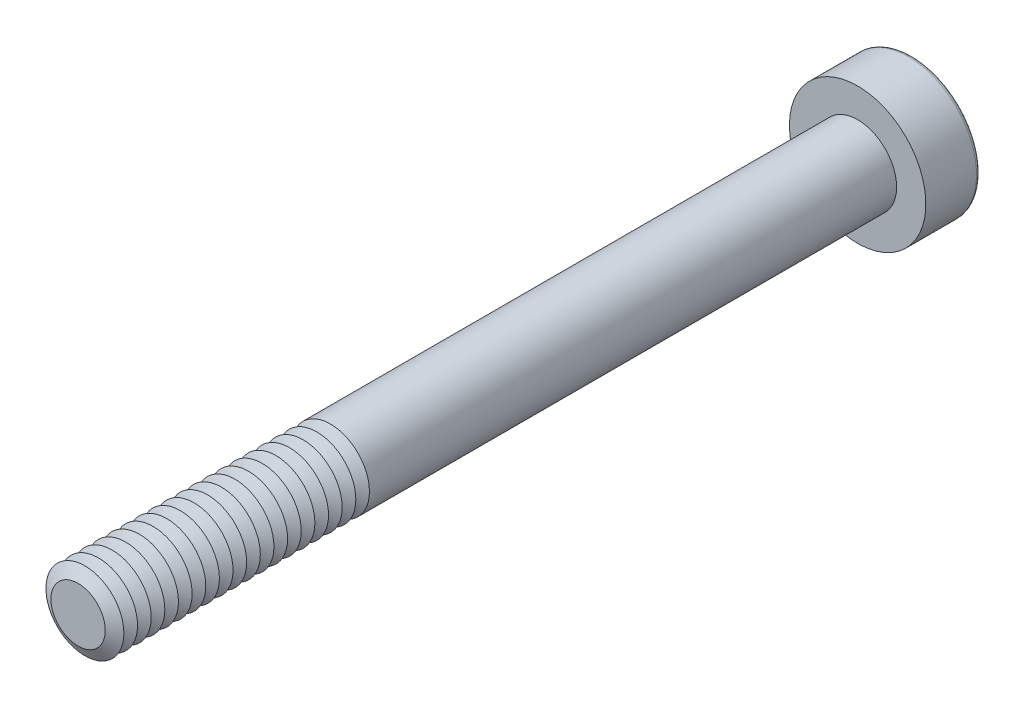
ISO-10303-21;
HEADER;
FILE_DESCRIPTION(('STEP AP214'),'2;1');
FILE_NAME('part.step','',(''),(''),'','','');
FILE_SCHEMA(('AUTOMOTIVE_DESIGN { 1 0 10303 214 1 1 1 1 }'));
ENDSEC;
DATA;
#1=APPLICATION_CONTEXT('core data for automotive mechanical design processes');
#2=APPLICATION_PROTOCOL_DEFINITION('international standard','automotive_design',2000,#1);
#3=PRODUCT_CONTEXT('',#1,'mechanical');
#4=PRODUCT('Part','Part','',(#3));
#5=PRODUCT_RELATED_PRODUCT_CATEGORY('part','',(#4));
#6=PRODUCT_DEFINITION_FORMATION('','',#4);
#7=PRODUCT_DEFINITION_CONTEXT('part definition',#1,'design');
#8=PRODUCT_DEFINITION('design','',#6,#7);
#9=PRODUCT_DEFINITION_SHAPE('','',#8);
#10=(LENGTH_UNIT() NAMED_UNIT(*) SI_UNIT(.MILLI.,.METRE.));
#11=(NAMED_UNIT(*) PLANE_ANGLE_UNIT() SI_UNIT($,.RADIAN.));
#12=(NAMED_UNIT(*) SI_UNIT($,.STERADIAN.) SOLID_ANGLE_UNIT());
#13=UNCERTAINTY_MEASURE_WITH_UNIT(LENGTH_MEASURE(1.E-05),#10,'distance_accuracy_value','');
#14=(GEOMETRIC_REPRESENTATION_CONTEXT(3) GLOBAL_UNCERTAINTY_ASSIGNED_CONTEXT((#13)) GLOBAL_UNIT_ASSIGNED_CONTEXT((#10,
#11,#12)) REPRESENTATION_CONTEXT('',''));
#15=CARTESIAN_POINT('',(0.,0.,0.));
#16=DIRECTION('',(0.,0.,1.));
#17=DIRECTION('',(1.,0.,0.));
#18=AXIS2_PLACEMENT_3D('',#15,#16,#17);
#19=CARTESIAN_POINT('',(0.,0.,37.55));
#20=DIRECTION('',(0.,0.,1.));
#21=DIRECTION('',(1.,0.,0.));
#22=AXIS2_PLACEMENT_3D('',#19,#20,#21);
#23=CONICAL_SURFACE('',#22,2.,1.04719755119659);
#24=CARTESIAN_POINT('',(0.,0.,37.2));
#25=DIRECTION('',(0.,0.,1.));
#26=DIRECTION('',(1.,0.,0.));
#27=AXIS2_PLACEMENT_3D('',#24,#25,#26);
#28=CIRCLE('',#27,1.39378221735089);
#29=CARTESIAN_POINT('',(1.39378221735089,0.,37.2));
#30=VERTEX_POINT('',#29);
#31=EDGE_CURVE('E314',#30,#30,#28,.T.);
#32=ORIENTED_EDGE('',*,*,#31,.T.);
#33=EDGE_LOOP('',(#32));
#34=FACE_BOUND('',#33,.T.);
#35=CARTESIAN_POINT('',(0.,0.,37.55));
#36=DIRECTION('',(0.,0.,1.));
#37=DIRECTION('',(1.,0.,0.));
#38=AXIS2_PLACEMENT_3D('',#35,#36,#37);
#39=CIRCLE('',#38,2.);
#40=CARTESIAN_POINT('',(2.,0.,37.55));
#41=VERTEX_POINT('',#40);
#42=EDGE_CURVE('E317',#41,#41,#39,.T.);
#43=ORIENTED_EDGE('',*,*,#42,.F.);
#44=EDGE_LOOP('',(#43));
#45=FACE_BOUND('',#44,.T.);
#46=ADVANCED_FACE('F39',(#34,#45),#23,.T.);
#47=CARTESIAN_POINT('',(0.,0.,37.2));
#48=DIRECTION('',(0.,0.,-1.));
#49=DIRECTION('',(-1.,0.,0.));
#50=AXIS2_PLACEMENT_3D('',#47,#48,#49);
#51=CONICAL_SURFACE('',#50,1.39378221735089,1.0471975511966);
#52=CARTESIAN_POINT('',(0.,0.,36.85));
#53=DIRECTION('',(0.,0.,1.));
#54=DIRECTION('',(1.,0.,0.));
#55=AXIS2_PLACEMENT_3D('',#52,#53,#54);
#56=CIRCLE('',#55,2.);
#57=CARTESIAN_POINT('',(2.,0.,36.85));
#58=VERTEX_POINT('',#57);
#59=EDGE_CURVE('E325',#58,#58,#56,.T.);
#60=ORIENTED_EDGE('',*,*,#59,.T.);
#61=EDGE_LOOP('',(#60));
#62=FACE_BOUND('',#61,.T.);
#63=ORIENTED_EDGE('',*,*,#31,.F.);
#64=EDGE_LOOP('',(#63));
#65=FACE_BOUND('',#64,.T.);
#66=ADVANCED_FACE('F245',(#62,#65),#51,.T.);
#67=CARTESIAN_POINT('',(0.,0.,40.));
#68=DIRECTION('',(0.,0.,1.));
#69=DIRECTION('',(1.,0.,0.));
#70=AXIS2_PLACEMENT_3D('',#67,#68,#69);
#71=PLANE('',#70);
#72=CARTESIAN_POINT('',(0.,0.,40.));
#73=DIRECTION('',(0.,0.,1.));
#74=DIRECTION('',(1.,0.,0.));
#75=AXIS2_PLACEMENT_3D('',#72,#73,#74);
#76=CIRCLE('',#75,1.39378221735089);
#77=CARTESIAN_POINT('',(1.39378221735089,0.,40.));
#78=VERTEX_POINT('',#77);
#79=EDGE_CURVE('E174',#78,#78,#76,.T.);
#80=ORIENTED_EDGE('',*,*,#79,.T.);
#81=EDGE_LOOP('',(#80));
#82=FACE_BOUND('',#81,.T.);
#83=ADVANCED_FACE('F251',(#82),#71,.T.);
#84=CARTESIAN_POINT('',(0.,0.,40.));
#85=DIRECTION('',(0.,0.,-1.));
#86=DIRECTION('',(-1.,0.,0.));
#87=AXIS2_PLACEMENT_3D('',#84,#85,#86);
#88=CONICAL_SURFACE('',#87,1.39378221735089,1.0471975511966);
#89=CARTESIAN_POINT('',(0.,0.,39.65));
#90=DIRECTION('',(0.,0.,1.));
#91=DIRECTION('',(1.,0.,0.));
#92=AXIS2_PLACEMENT_3D('',#89,#90,#91);
#93=CIRCLE('',#92,2.);
#94=CARTESIAN_POINT('',(2.,0.,39.65));
#95=VERTEX_POINT('',#94);
#96=EDGE_CURVE('E291',#95,#95,#93,.T.);
#97=ORIENTED_EDGE('',*,*,#96,.T.);
#98=EDGE_LOOP('',(#97));
#99=FACE_BOUND('',#98,.T.);
#100=ORIENTED_EDGE('',*,*,#79,.F.);
#101=EDGE_LOOP('',(#100));
#102=FACE_BOUND('',#101,.T.);
#103=ADVANCED_FACE('F199',(#99,#102),#88,.T.);
#104=CARTESIAN_POINT('',(0.,0.,39.65));
#105=DIRECTION('',(0.,0.,1.));
#106=DIRECTION('',(1.,0.,0.));
#107=AXIS2_PLACEMENT_3D('',#104,#105,#106);
#108=CONICAL_SURFACE('',#107,2.,1.04719755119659);
#109=CARTESIAN_POINT('',(0.,0.,39.3));
#110=DIRECTION('',(0.,0.,1.));
#111=DIRECTION('',(1.,0.,0.));
#112=AXIS2_PLACEMENT_3D('',#109,#110,#111);
#113=CIRCLE('',#112,1.39378221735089);
#114=CARTESIAN_POINT('',(1.39378221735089,0.,39.3));
#115=VERTEX_POINT('',#114);
#116=EDGE_CURVE('E288',#115,#115,#113,.T.);
#117=ORIENTED_EDGE('',*,*,#116,.T.);
#118=EDGE_LOOP('',(#117));
#119=FACE_BOUND('',#118,.T.);
#120=ORIENTED_EDGE('',*,*,#96,.F.);
#121=EDGE_LOOP('',(#120));
#122=FACE_BOUND('',#121,.T.);
#123=ADVANCED_FACE('F277',(#119,#122),#108,.T.);
#124=CARTESIAN_POINT('',(0.,0.,39.3));
#125=DIRECTION('',(0.,0.,-1.));
#126=DIRECTION('',(-1.,0.,0.));
#127=AXIS2_PLACEMENT_3D('',#124,#125,#126);
#128=CONICAL_SURFACE('',#127,1.39378221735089,1.0471975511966);
#129=CARTESIAN_POINT('',(0.,0.,38.95));
#130=DIRECTION('',(0.,0.,1.));
#131=DIRECTION('',(1.,0.,0.));
#132=AXIS2_PLACEMENT_3D('',#129,#130,#131);
#133=CIRCLE('',#132,2.);
#134=CARTESIAN_POINT('',(2.,0.,38.95));
#135=VERTEX_POINT('',#134);
#136=EDGE_CURVE('E300',#135,#135,#133,.T.);
#137=ORIENTED_EDGE('',*,*,#136,.T.);
#138=EDGE_LOOP('',(#137));
#139=FACE_BOUND('',#138,.T.);
#140=ORIENTED_EDGE('',*,*,#116,.F.);
#141=EDGE_LOOP('',(#140));
#142=FACE_BOUND('',#141,.T.);
#143=ADVANCED_FACE('F274',(#139,#142),#128,.T.);
#144=CARTESIAN_POINT('',(0.,0.,38.95));
#145=DIRECTION('',(0.,0.,1.));
#146=DIRECTION('',(1.,0.,0.));
#147=AXIS2_PLACEMENT_3D('',#144,#145,#146);
#148=CONICAL_SURFACE('',#147,2.,1.04719755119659);
#149=CARTESIAN_POINT('',(0.,0.,38.6));
#150=DIRECTION('',(0.,0.,1.));
#151=DIRECTION('',(1.,0.,0.));
#152=AXIS2_PLACEMENT_3D('',#149,#150,#151);
#153=CIRCLE('',#152,1.39378221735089);
#154=CARTESIAN_POINT('',(1.39378221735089,0.,38.6));
#155=VERTEX_POINT('',#154);
#156=EDGE_CURVE('E293',#155,#155,#153,.T.);
#157=ORIENTED_EDGE('',*,*,#156,.T.);
#158=EDGE_LOOP('',(#157));
#159=FACE_BOUND('',#158,.T.);
#160=ORIENTED_EDGE('',*,*,#136,.F.);
#161=EDGE_LOOP('',(#160));
#162=FACE_BOUND('',#161,.T.);
#163=ADVANCED_FACE('F270',(#159,#162),#148,.T.);
#164=CARTESIAN_POINT('',(0.,0.,38.6));
#165=DIRECTION('',(0.,0.,-1.));
#166=DIRECTION('',(-1.,0.,0.));
#167=AXIS2_PLACEMENT_3D('',#164,#165,#166);
#168=CONICAL_SURFACE('',#167,1.39378221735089,1.0471975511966);
#169=CARTESIAN_POINT('',(0.,0.,38.25));
#170=DIRECTION('',(0.,0.,1.));
#171=DIRECTION('',(1.,0.,0.));
#172=AXIS2_PLACEMENT_3D('',#169,#170,#171);
#173=CIRCLE('',#172,2.);
#174=CARTESIAN_POINT('',(2.,0.,38.25));
#175=VERTEX_POINT('',#174);
#176=EDGE_CURVE('E310',#175,#175,#173,.T.);
#177=ORIENTED_EDGE('',*,*,#176,.T.);
#178=EDGE_LOOP('',(#177));
#179=FACE_BOUND('',#178,.T.);
#180=ORIENTED_EDGE('',*,*,#156,.F.);
#181=EDGE_LOOP('',(#180));
#182=FACE_BOUND('',#181,.T.);
#183=ADVANCED_FACE('F266',(#179,#182),#168,.T.);
#184=CARTESIAN_POINT('',(0.,0.,38.25));
#185=DIRECTION('',(0.,0.,1.));
#186=DIRECTION('',(1.,0.,0.));
#187=AXIS2_PLACEMENT_3D('',#184,#185,#186);
#188=CONICAL_SURFACE('',#187,2.,1.04719755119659);
#189=CARTESIAN_POINT('',(0.,0.,37.9));
#190=DIRECTION('',(0.,0.,1.));
#191=DIRECTION('',(1.,0.,0.));
#192=AXIS2_PLACEMENT_3D('',#189,#190,#191);
#193=CIRCLE('',#192,1.39378221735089);
#194=CARTESIAN_POINT('',(1.39378221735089,0.,37.9));
#195=VERTEX_POINT('',#194);
#196=EDGE_CURVE('E306',#195,#195,#193,.T.);
#197=ORIENTED_EDGE('',*,*,#196,.T.);
#198=EDGE_LOOP('',(#197));
#199=FACE_BOUND('',#198,.T.);
#200=ORIENTED_EDGE('',*,*,#176,.F.);
#201=EDGE_LOOP('',(#200));
#202=FACE_BOUND('',#201,.T.);
#203=ADVANCED_FACE('F262',(#199,#202),#188,.T.);
#204=CARTESIAN_POINT('',(0.,0.,37.9));
#205=DIRECTION('',(0.,0.,-1.));
#206=DIRECTION('',(-1.,0.,0.));
#207=AXIS2_PLACEMENT_3D('',#204,#205,#206);
#208=CONICAL_SURFACE('',#207,1.39378221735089,1.0471975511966);
#209=ORIENTED_EDGE('',*,*,#42,.T.);
#210=EDGE_LOOP('',(#209));
#211=FACE_BOUND('',#210,.T.);
#212=ORIENTED_EDGE('',*,*,#196,.F.);
#213=EDGE_LOOP('',(#212));
#214=FACE_BOUND('',#213,.T.);
#215=ADVANCED_FACE('F258',(#211,#214),#208,.T.);
#216=CARTESIAN_POINT('',(0.,0.,36.85));
#217=DIRECTION('',(0.,0.,1.));
#218=DIRECTION('',(1.,0.,0.));
#219=AXIS2_PLACEMENT_3D('',#216,#217,#218);
#220=CONICAL_SURFACE('',#219,2.,1.04719755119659);
#221=CARTESIAN_POINT('',(0.,0.,36.5));
#222=DIRECTION('',(0.,0.,1.));
#223=DIRECTION('',(1.,0.,0.));
#224=AXIS2_PLACEMENT_3D('',#221,#222,#223);
#225=CIRCLE('',#224,1.39378221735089);
#226=CARTESIAN_POINT('',(1.39378221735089,0.,36.5));
#227=VERTEX_POINT('',#226);
#228=EDGE_CURVE('E321',#227,#227,#225,.T.);
#229=ORIENTED_EDGE('',*,*,#228,.T.);
#230=EDGE_LOOP('',(#229));
#231=FACE_BOUND('',#230,.T.);
#232=ORIENTED_EDGE('',*,*,#59,.F.);
#233=EDGE_LOOP('',(#232));
#234=FACE_BOUND('',#233,.T.);
#235=ADVANCED_FACE('F261',(#231,#234),#220,.T.);
#236=CARTESIAN_POINT('',(0.,0.,36.5));
#237=DIRECTION('',(0.,0.,-1.));
#238=DIRECTION('',(-1.,0.,0.));
#239=AXIS2_PLACEMENT_3D('',#236,#237,#238);
#240=CONICAL_SURFACE('',#239,1.39378221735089,1.0471975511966);
#241=CARTESIAN_POINT('',(0.,0.,36.15));
#242=DIRECTION('',(0.,0.,1.));
#243=DIRECTION('',(1.,0.,0.));
#244=AXIS2_PLACEMENT_3D('',#241,#242,#243);
#245=CIRCLE('',#244,2.);
#246=CARTESIAN_POINT('',(2.,0.,36.15));
#247=VERTEX_POINT('',#246);
#248=EDGE_CURVE('E333',#247,#247,#245,.T.);
#249=ORIENTED_EDGE('',*,*,#248,.T.);
#250=EDGE_LOOP('',(#249));
#251=FACE_BOUND('',#250,.T.);
#252=ORIENTED_EDGE('',*,*,#228,.F.);
#253=EDGE_LOOP('',(#252));
#254=FACE_BOUND('',#253,.T.);
#255=ADVANCED_FACE('F544',(#251,#254),#240,.T.);
#256=CARTESIAN_POINT('',(0.,0.,36.15));
#257=DIRECTION('',(0.,0.,1.));
#258=DIRECTION('',(1.,0.,0.));
#259=AXIS2_PLACEMENT_3D('',#256,#257,#258);
#260=CONICAL_SURFACE('',#259,2.,1.04719755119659);
#261=CARTESIAN_POINT('',(0.,0.,35.8));
#262=DIRECTION('',(0.,0.,1.));
#263=DIRECTION('',(1.,0.,0.));
#264=AXIS2_PLACEMENT_3D('',#261,#262,#263);
#265=CIRCLE('',#264,1.39378221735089);
#266=CARTESIAN_POINT('',(1.39378221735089,0.,35.8));
#267=VERTEX_POINT('',#266);
#268=EDGE_CURVE('E329',#267,#267,#265,.T.);
#269=ORIENTED_EDGE('',*,*,#268,.T.);
#270=EDGE_LOOP('',(#269));
#271=FACE_BOUND('',#270,.T.);
#272=ORIENTED_EDGE('',*,*,#248,.F.);
#273=EDGE_LOOP('',(#272));
#274=FACE_BOUND('',#273,.T.);
#275=ADVANCED_FACE('F540',(#271,#274),#260,.T.);
#276=CARTESIAN_POINT('',(0.,0.,35.8));
#277=DIRECTION('',(0.,0.,-1.));
#278=DIRECTION('',(-1.,0.,0.));
#279=AXIS2_PLACEMENT_3D('',#276,#277,#278);
#280=CONICAL_SURFACE('',#279,1.39378221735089,1.0471975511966);
#281=CARTESIAN_POINT('',(0.,0.,35.45));
#282=DIRECTION('',(0.,0.,1.));
#283=DIRECTION('',(1.,0.,0.));
#284=AXIS2_PLACEMENT_3D('',#281,#282,#283);
#285=CIRCLE('',#284,2.);
#286=CARTESIAN_POINT('',(2.,0.,35.45));
#287=VERTEX_POINT('',#286);
#288=EDGE_CURVE('E340',#287,#287,#285,.T.);
#289=ORIENTED_EDGE('',*,*,#288,.T.);
#290=EDGE_LOOP('',(#289));
#291=FACE_BOUND('',#290,.T.);
#292=ORIENTED_EDGE('',*,*,#268,.F.);
#293=EDGE_LOOP('',(#292));
#294=FACE_BOUND('',#293,.T.);
#295=ADVANCED_FACE('F536',(#291,#294),#280,.T.);
#296=CARTESIAN_POINT('',(0.,0.,35.45));
#297=DIRECTION('',(0.,0.,1.));
#298=DIRECTION('',(1.,0.,0.));
#299=AXIS2_PLACEMENT_3D('',#296,#297,#298);
#300=CONICAL_SURFACE('',#299,2.,1.04719755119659);
#301=CARTESIAN_POINT('',(0.,0.,35.1));
#302=DIRECTION('',(0.,0.,1.));
#303=DIRECTION('',(1.,0.,0.));
#304=AXIS2_PLACEMENT_3D('',#301,#302,#303);
#305=CIRCLE('',#304,1.39378221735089);
#306=CARTESIAN_POINT('',(1.39378221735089,0.,35.1));
#307=VERTEX_POINT('',#306);
#308=EDGE_CURVE('E337',#307,#307,#305,.T.);
#309=ORIENTED_EDGE('',*,*,#308,.T.);
#310=EDGE_LOOP('',(#309));
#311=FACE_BOUND('',#310,.T.);
#312=ORIENTED_EDGE('',*,*,#288,.F.);
#313=EDGE_LOOP('',(#312));
#314=FACE_BOUND('',#313,.T.);
#315=ADVANCED_FACE('F532',(#311,#314),#300,.T.);
#316=CARTESIAN_POINT('',(0.,0.,35.1));
#317=DIRECTION('',(0.,0.,-1.));
#318=DIRECTION('',(-1.,0.,0.));
#319=AXIS2_PLACEMENT_3D('',#316,#317,#318);
#320=CONICAL_SURFACE('',#319,1.39378221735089,1.0471975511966);
#321=CARTESIAN_POINT('',(0.,0.,34.75));
#322=DIRECTION('',(0.,0.,1.));
#323=DIRECTION('',(1.,0.,0.));
#324=AXIS2_PLACEMENT_3D('',#321,#322,#323);
#325=CIRCLE('',#324,2.);
#326=CARTESIAN_POINT('',(2.,0.,34.75));
#327=VERTEX_POINT('',#326);
#328=EDGE_CURVE('E347',#327,#327,#325,.T.);
#329=ORIENTED_EDGE('',*,*,#328,.T.);
#330=EDGE_LOOP('',(#329));
#331=FACE_BOUND('',#330,.T.);
#332=ORIENTED_EDGE('',*,*,#308,.F.);
#333=EDGE_LOOP('',(#332));
#334=FACE_BOUND('',#333,.T.);
#335=ADVANCED_FACE('F528',(#331,#334),#320,.T.);
#336=CARTESIAN_POINT('',(0.,0.,34.75));
#337=DIRECTION('',(0.,0.,1.));
#338=DIRECTION('',(1.,0.,0.));
#339=AXIS2_PLACEMENT_3D('',#336,#337,#338);
#340=CONICAL_SURFACE('',#339,2.,1.04719755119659);
#341=CARTESIAN_POINT('',(0.,0.,34.4));
#342=DIRECTION('',(0.,0.,1.));
#343=DIRECTION('',(1.,0.,0.));
#344=AXIS2_PLACEMENT_3D('',#341,#342,#343);
#345=CIRCLE('',#344,1.39378221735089);
#346=CARTESIAN_POINT('',(1.39378221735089,0.,34.4));
#347=VERTEX_POINT('',#346);
#348=EDGE_CURVE('E343',#347,#347,#345,.T.);
#349=ORIENTED_EDGE('',*,*,#348,.T.);
#350=EDGE_LOOP('',(#349));
#351=FACE_BOUND('',#350,.T.);
#352=ORIENTED_EDGE('',*,*,#328,.F.);
#353=EDGE_LOOP('',(#352));
#354=FACE_BOUND('',#353,.T.);
#355=ADVANCED_FACE('F524',(#351,#354),#340,.T.);
#356=CARTESIAN_POINT('',(0.,0.,34.4));
#357=DIRECTION('',(0.,0.,-1.));
#358=DIRECTION('',(-1.,0.,0.));
#359=AXIS2_PLACEMENT_3D('',#356,#357,#358);
#360=CONICAL_SURFACE('',#359,1.39378221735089,1.0471975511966);
#361=CARTESIAN_POINT('',(0.,0.,34.05));
#362=DIRECTION('',(0.,0.,1.));
#363=DIRECTION('',(1.,0.,0.));
#364=AXIS2_PLACEMENT_3D('',#361,#362,#363);
#365=CIRCLE('',#364,2.);
#366=CARTESIAN_POINT('',(2.,0.,34.05));
#367=VERTEX_POINT('',#366);
#368=EDGE_CURVE('E355',#367,#367,#365,.T.);
#369=ORIENTED_EDGE('',*,*,#368,.T.);
#370=EDGE_LOOP('',(#369));
#371=FACE_BOUND('',#370,.T.);
#372=ORIENTED_EDGE('',*,*,#348,.F.);
#373=EDGE_LOOP('',(#372));
#374=FACE_BOUND('',#373,.T.);
#375=ADVANCED_FACE('F520',(#371,#374),#360,.T.);
#376=CARTESIAN_POINT('',(0.,0.,34.05));
#377=DIRECTION('',(0.,0.,1.));
#378=DIRECTION('',(1.,0.,0.));
#379=AXIS2_PLACEMENT_3D('',#376,#377,#378);
#380=CONICAL_SURFACE('',#379,2.,1.04719755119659);
#381=CARTESIAN_POINT('',(0.,0.,33.7));
#382=DIRECTION('',(0.,0.,1.));
#383=DIRECTION('',(1.,0.,0.));
#384=AXIS2_PLACEMENT_3D('',#381,#382,#383);
#385=CIRCLE('',#384,1.39378221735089);
#386=CARTESIAN_POINT('',(1.39378221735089,0.,33.7));
#387=VERTEX_POINT('',#386);
#388=EDGE_CURVE('E351',#387,#387,#385,.T.);
#389=ORIENTED_EDGE('',*,*,#388,.T.);
#390=EDGE_LOOP('',(#389));
#391=FACE_BOUND('',#390,.T.);
#392=ORIENTED_EDGE('',*,*,#368,.F.);
#393=EDGE_LOOP('',(#392));
#394=FACE_BOUND('',#393,.T.);
#395=ADVANCED_FACE('F516',(#391,#394),#380,.T.);
#396=CARTESIAN_POINT('',(0.,0.,33.7));
#397=DIRECTION('',(0.,0.,-1.));
#398=DIRECTION('',(-1.,0.,0.));
#399=AXIS2_PLACEMENT_3D('',#396,#397,#398);
#400=CONICAL_SURFACE('',#399,1.39378221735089,1.0471975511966);
#401=CARTESIAN_POINT('',(0.,0.,33.35));
#402=DIRECTION('',(0.,0.,1.));
#403=DIRECTION('',(1.,0.,0.));
#404=AXIS2_PLACEMENT_3D('',#401,#402,#403);
#405=CIRCLE('',#404,2.);
#406=CARTESIAN_POINT('',(2.,0.,33.35));
#407=VERTEX_POINT('',#406);
#408=EDGE_CURVE('E363',#407,#407,#405,.T.);
#409=ORIENTED_EDGE('',*,*,#408,.T.);
#410=EDGE_LOOP('',(#409));
#411=FACE_BOUND('',#410,.T.);
#412=ORIENTED_EDGE('',*,*,#388,.F.);
#413=EDGE_LOOP('',(#412));
#414=FACE_BOUND('',#413,.T.);
#415=ADVANCED_FACE('F512',(#411,#414),#400,.T.);
#416=CARTESIAN_POINT('',(0.,0.,33.35));
#417=DIRECTION('',(0.,0.,1.));
#418=DIRECTION('',(1.,0.,0.));
#419=AXIS2_PLACEMENT_3D('',#416,#417,#418);
#420=CONICAL_SURFACE('',#419,2.,1.04719755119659);
#421=CARTESIAN_POINT('',(0.,0.,33.));
#422=DIRECTION('',(0.,0.,1.));
#423=DIRECTION('',(1.,0.,0.));
#424=AXIS2_PLACEMENT_3D('',#421,#422,#423);
#425=CIRCLE('',#424,1.39378221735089);
#426=CARTESIAN_POINT('',(1.39378221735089,0.,33.));
#427=VERTEX_POINT('',#426);
#428=EDGE_CURVE('E359',#427,#427,#425,.T.);
#429=ORIENTED_EDGE('',*,*,#428,.T.);
#430=EDGE_LOOP('',(#429));
#431=FACE_BOUND('',#430,.T.);
#432=ORIENTED_EDGE('',*,*,#408,.F.);
#433=EDGE_LOOP('',(#432));
#434=FACE_BOUND('',#433,.T.);
#435=ADVANCED_FACE('F508',(#431,#434),#420,.T.);
#436=CARTESIAN_POINT('',(0.,0.,33.));
#437=DIRECTION('',(0.,0.,-1.));
#438=DIRECTION('',(-1.,0.,0.));
#439=AXIS2_PLACEMENT_3D('',#436,#437,#438);
#440=CONICAL_SURFACE('',#439,1.39378221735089,1.0471975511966);
#441=CARTESIAN_POINT('',(0.,0.,32.65));
#442=DIRECTION('',(0.,0.,1.));
#443=DIRECTION('',(1.,0.,0.));
#444=AXIS2_PLACEMENT_3D('',#441,#442,#443);
#445=CIRCLE('',#444,2.);
#446=CARTESIAN_POINT('',(2.,0.,32.65));
#447=VERTEX_POINT('',#446);
#448=EDGE_CURVE('E371',#447,#447,#445,.T.);
#449=ORIENTED_EDGE('',*,*,#448,.T.);
#450=EDGE_LOOP('',(#449));
#451=FACE_BOUND('',#450,.T.);
#452=ORIENTED_EDGE('',*,*,#428,.F.);
#453=EDGE_LOOP('',(#452));
#454=FACE_BOUND('',#453,.T.);
#455=ADVANCED_FACE('F504',(#451,#454),#440,.T.);
#456=CARTESIAN_POINT('',(0.,0.,32.65));
#457=DIRECTION('',(0.,0.,1.));
#458=DIRECTION('',(1.,0.,0.));
#459=AXIS2_PLACEMENT_3D('',#456,#457,#458);
#460=CONICAL_SURFACE('',#459,2.,1.04719755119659);
#461=CARTESIAN_POINT('',(0.,0.,32.3));
#462=DIRECTION('',(0.,0.,1.));
#463=DIRECTION('',(1.,0.,0.));
#464=AXIS2_PLACEMENT_3D('',#461,#462,#463);
#465=CIRCLE('',#464,1.39378221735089);
#466=CARTESIAN_POINT('',(1.39378221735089,0.,32.3));
#467=VERTEX_POINT('',#466);
#468=EDGE_CURVE('E367',#467,#467,#465,.T.);
#469=ORIENTED_EDGE('',*,*,#468,.T.);
#470=EDGE_LOOP('',(#469));
#471=FACE_BOUND('',#470,.T.);
#472=ORIENTED_EDGE('',*,*,#448,.F.);
#473=EDGE_LOOP('',(#472));
#474=FACE_BOUND('',#473,.T.);
#475=ADVANCED_FACE('F500',(#471,#474),#460,.T.);
#476=CARTESIAN_POINT('',(0.,0.,32.3));
#477=DIRECTION('',(0.,0.,-1.));
#478=DIRECTION('',(-1.,0.,0.));
#479=AXIS2_PLACEMENT_3D('',#476,#477,#478);
#480=CONICAL_SURFACE('',#479,1.39378221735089,1.0471975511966);
#481=CARTESIAN_POINT('',(0.,0.,31.95));
#482=DIRECTION('',(0.,0.,1.));
#483=DIRECTION('',(1.,0.,0.));
#484=AXIS2_PLACEMENT_3D('',#481,#482,#483);
#485=CIRCLE('',#484,2.);
#486=CARTESIAN_POINT('',(2.,0.,31.95));
#487=VERTEX_POINT('',#486);
#488=EDGE_CURVE('E379',#487,#487,#485,.T.);
#489=ORIENTED_EDGE('',*,*,#488,.T.);
#490=EDGE_LOOP('',(#489));
#491=FACE_BOUND('',#490,.T.);
#492=ORIENTED_EDGE('',*,*,#468,.F.);
#493=EDGE_LOOP('',(#492));
#494=FACE_BOUND('',#493,.T.);
#495=ADVANCED_FACE('F496',(#491,#494),#480,.T.);
#496=CARTESIAN_POINT('',(0.,0.,31.95));
#497=DIRECTION('',(0.,0.,1.));
#498=DIRECTION('',(1.,0.,0.));
#499=AXIS2_PLACEMENT_3D('',#496,#497,#498);
#500=CONICAL_SURFACE('',#499,2.,1.04719755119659);
#501=CARTESIAN_POINT('',(0.,0.,31.6));
#502=DIRECTION('',(0.,0.,1.));
#503=DIRECTION('',(1.,0.,0.));
#504=AXIS2_PLACEMENT_3D('',#501,#502,#503);
#505=CIRCLE('',#504,1.39378221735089);
#506=CARTESIAN_POINT('',(1.39378221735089,0.,31.6));
#507=VERTEX_POINT('',#506);
#508=EDGE_CURVE('E375',#507,#507,#505,.T.);
#509=ORIENTED_EDGE('',*,*,#508,.T.);
#510=EDGE_LOOP('',(#509));
#511=FACE_BOUND('',#510,.T.);
#512=ORIENTED_EDGE('',*,*,#488,.F.);
#513=EDGE_LOOP('',(#512));
#514=FACE_BOUND('',#513,.T.);
#515=ADVANCED_FACE('F492',(#511,#514),#500,.T.);
#516=CARTESIAN_POINT('',(0.,0.,31.6));
#517=DIRECTION('',(0.,0.,-1.));
#518=DIRECTION('',(-1.,0.,0.));
#519=AXIS2_PLACEMENT_3D('',#516,#517,#518);
#520=CONICAL_SURFACE('',#519,1.39378221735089,1.0471975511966);
#521=CARTESIAN_POINT('',(0.,0.,31.25));
#522=DIRECTION('',(0.,0.,1.));
#523=DIRECTION('',(1.,0.,0.));
#524=AXIS2_PLACEMENT_3D('',#521,#522,#523);
#525=CIRCLE('',#524,2.);
#526=CARTESIAN_POINT('',(2.,0.,31.25));
#527=VERTEX_POINT('',#526);
#528=EDGE_CURVE('E387',#527,#527,#525,.T.);
#529=ORIENTED_EDGE('',*,*,#528,.T.);
#530=EDGE_LOOP('',(#529));
#531=FACE_BOUND('',#530,.T.);
#532=ORIENTED_EDGE('',*,*,#508,.F.);
#533=EDGE_LOOP('',(#532));
#534=FACE_BOUND('',#533,.T.);
#535=ADVANCED_FACE('F488',(#531,#534),#520,.T.);
#536=CARTESIAN_POINT('',(0.,0.,31.25));
#537=DIRECTION('',(0.,0.,1.));
#538=DIRECTION('',(1.,0.,0.));
#539=AXIS2_PLACEMENT_3D('',#536,#537,#538);
#540=CONICAL_SURFACE('',#539,2.,1.04719755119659);
#541=CARTESIAN_POINT('',(0.,0.,30.9));
#542=DIRECTION('',(0.,0.,1.));
#543=DIRECTION('',(1.,0.,0.));
#544=AXIS2_PLACEMENT_3D('',#541,#542,#543);
#545=CIRCLE('',#544,1.39378221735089);
#546=CARTESIAN_POINT('',(1.39378221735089,0.,30.9));
#547=VERTEX_POINT('',#546);
#548=EDGE_CURVE('E383',#547,#547,#545,.T.);
#549=ORIENTED_EDGE('',*,*,#548,.T.);
#550=EDGE_LOOP('',(#549));
#551=FACE_BOUND('',#550,.T.);
#552=ORIENTED_EDGE('',*,*,#528,.F.);
#553=EDGE_LOOP('',(#552));
#554=FACE_BOUND('',#553,.T.);
#555=ADVANCED_FACE('F484',(#551,#554),#540,.T.);
#556=CARTESIAN_POINT('',(0.,0.,30.9));
#557=DIRECTION('',(0.,0.,-1.));
#558=DIRECTION('',(-1.,0.,0.));
#559=AXIS2_PLACEMENT_3D('',#556,#557,#558);
#560=CONICAL_SURFACE('',#559,1.39378221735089,1.0471975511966);
#561=CARTESIAN_POINT('',(0.,0.,30.55));
#562=DIRECTION('',(0.,0.,1.));
#563=DIRECTION('',(1.,0.,0.));
#564=AXIS2_PLACEMENT_3D('',#561,#562,#563);
#565=CIRCLE('',#564,2.);
#566=CARTESIAN_POINT('',(2.,0.,30.55));
#567=VERTEX_POINT('',#566);
#568=EDGE_CURVE('E395',#567,#567,#565,.T.);
#569=ORIENTED_EDGE('',*,*,#568,.T.);
#570=EDGE_LOOP('',(#569));
#571=FACE_BOUND('',#570,.T.);
#572=ORIENTED_EDGE('',*,*,#548,.F.);
#573=EDGE_LOOP('',(#572));
#574=FACE_BOUND('',#573,.T.);
#575=ADVANCED_FACE('F480',(#571,#574),#560,.T.);
#576=CARTESIAN_POINT('',(0.,0.,30.55));
#577=DIRECTION('',(0.,0.,1.));
#578=DIRECTION('',(1.,0.,0.));
#579=AXIS2_PLACEMENT_3D('',#576,#577,#578);
#580=CONICAL_SURFACE('',#579,2.,1.04719755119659);
#581=CARTESIAN_POINT('',(0.,0.,30.2));
#582=DIRECTION('',(0.,0.,1.));
#583=DIRECTION('',(1.,0.,0.));
#584=AXIS2_PLACEMENT_3D('',#581,#582,#583);
#585=CIRCLE('',#584,1.39378221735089);
#586=CARTESIAN_POINT('',(1.39378221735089,0.,30.2));
#587=VERTEX_POINT('',#586);
#588=EDGE_CURVE('E391',#587,#587,#585,.T.);
#589=ORIENTED_EDGE('',*,*,#588,.T.);
#590=EDGE_LOOP('',(#589));
#591=FACE_BOUND('',#590,.T.);
#592=ORIENTED_EDGE('',*,*,#568,.F.);
#593=EDGE_LOOP('',(#592));
#594=FACE_BOUND('',#593,.T.);
#595=ADVANCED_FACE('F476',(#591,#594),#580,.T.);
#596=CARTESIAN_POINT('',(0.,0.,30.2));
#597=DIRECTION('',(0.,0.,-1.));
#598=DIRECTION('',(-1.,0.,0.));
#599=AXIS2_PLACEMENT_3D('',#596,#597,#598);
#600=CONICAL_SURFACE('',#599,1.39378221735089,1.0471975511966);
#601=CARTESIAN_POINT('',(0.,0.,29.85));
#602=DIRECTION('',(0.,0.,1.));
#603=DIRECTION('',(1.,0.,0.));
#604=AXIS2_PLACEMENT_3D('',#601,#602,#603);
#605=CIRCLE('',#604,2.);
#606=CARTESIAN_POINT('',(2.,0.,29.85));
#607=VERTEX_POINT('',#606);
#608=EDGE_CURVE('E403',#607,#607,#605,.T.);
#609=ORIENTED_EDGE('',*,*,#608,.T.);
#610=EDGE_LOOP('',(#609));
#611=FACE_BOUND('',#610,.T.);
#612=ORIENTED_EDGE('',*,*,#588,.F.);
#613=EDGE_LOOP('',(#612));
#614=FACE_BOUND('',#613,.T.);
#615=ADVANCED_FACE('F472',(#611,#614),#600,.T.);
#616=CARTESIAN_POINT('',(0.,0.,29.85));
#617=DIRECTION('',(0.,0.,1.));
#618=DIRECTION('',(1.,0.,0.));
#619=AXIS2_PLACEMENT_3D('',#616,#617,#618);
#620=CONICAL_SURFACE('',#619,2.,1.04719755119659);
#621=CARTESIAN_POINT('',(0.,0.,29.5));
#622=DIRECTION('',(0.,0.,1.));
#623=DIRECTION('',(1.,0.,0.));
#624=AXIS2_PLACEMENT_3D('',#621,#622,#623);
#625=CIRCLE('',#624,1.39378221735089);
#626=CARTESIAN_POINT('',(1.39378221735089,0.,29.5));
#627=VERTEX_POINT('',#626);
#628=EDGE_CURVE('E399',#627,#627,#625,.T.);
#629=ORIENTED_EDGE('',*,*,#628,.T.);
#630=EDGE_LOOP('',(#629));
#631=FACE_BOUND('',#630,.T.);
#632=ORIENTED_EDGE('',*,*,#608,.F.);
#633=EDGE_LOOP('',(#632));
#634=FACE_BOUND('',#633,.T.);
#635=ADVANCED_FACE('F468',(#631,#634),#620,.T.);
#636=CARTESIAN_POINT('',(0.,0.,29.5));
#637=DIRECTION('',(0.,0.,-1.));
#638=DIRECTION('',(-1.,0.,0.));
#639=AXIS2_PLACEMENT_3D('',#636,#637,#638);
#640=CONICAL_SURFACE('',#639,1.39378221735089,1.0471975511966);
#641=CARTESIAN_POINT('',(0.,0.,29.15));
#642=DIRECTION('',(0.,0.,1.));
#643=DIRECTION('',(1.,0.,0.));
#644=AXIS2_PLACEMENT_3D('',#641,#642,#643);
#645=CIRCLE('',#644,2.);
#646=CARTESIAN_POINT('',(2.,0.,29.15));
#647=VERTEX_POINT('',#646);
#648=EDGE_CURVE('E411',#647,#647,#645,.T.);
#649=ORIENTED_EDGE('',*,*,#648,.T.);
#650=EDGE_LOOP('',(#649));
#651=FACE_BOUND('',#650,.T.);
#652=ORIENTED_EDGE('',*,*,#628,.F.);
#653=EDGE_LOOP('',(#652));
#654=FACE_BOUND('',#653,.T.);
#655=ADVANCED_FACE('F464',(#651,#654),#640,.T.);
#656=CARTESIAN_POINT('',(0.,0.,29.15));
#657=DIRECTION('',(0.,0.,1.));
#658=DIRECTION('',(1.,0.,0.));
#659=AXIS2_PLACEMENT_3D('',#656,#657,#658);
#660=CONICAL_SURFACE('',#659,2.,1.04719755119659);
#661=CARTESIAN_POINT('',(0.,0.,28.8));
#662=DIRECTION('',(0.,0.,1.));
#663=DIRECTION('',(1.,0.,0.));
#664=AXIS2_PLACEMENT_3D('',#661,#662,#663);
#665=CIRCLE('',#664,1.39378221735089);
#666=CARTESIAN_POINT('',(1.39378221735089,0.,28.8));
#667=VERTEX_POINT('',#666);
#668=EDGE_CURVE('E407',#667,#667,#665,.T.);
#669=ORIENTED_EDGE('',*,*,#668,.T.);
#670=EDGE_LOOP('',(#669));
#671=FACE_BOUND('',#670,.T.);
#672=ORIENTED_EDGE('',*,*,#648,.F.);
#673=EDGE_LOOP('',(#672));
#674=FACE_BOUND('',#673,.T.);
#675=ADVANCED_FACE('F460',(#671,#674),#660,.T.);
#676=CARTESIAN_POINT('',(0.,0.,28.8));
#677=DIRECTION('',(0.,0.,-1.));
#678=DIRECTION('',(-1.,0.,0.));
#679=AXIS2_PLACEMENT_3D('',#676,#677,#678);
#680=CONICAL_SURFACE('',#679,1.39378221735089,1.0471975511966);
#681=CARTESIAN_POINT('',(0.,0.,28.45));
#682=DIRECTION('',(0.,0.,1.));
#683=DIRECTION('',(1.,0.,0.));
#684=AXIS2_PLACEMENT_3D('',#681,#682,#683);
#685=CIRCLE('',#684,2.);
#686=CARTESIAN_POINT('',(2.,0.,28.45));
#687=VERTEX_POINT('',#686);
#688=EDGE_CURVE('E419',#687,#687,#685,.T.);
#689=ORIENTED_EDGE('',*,*,#688,.T.);
#690=EDGE_LOOP('',(#689));
#691=FACE_BOUND('',#690,.T.);
#692=ORIENTED_EDGE('',*,*,#668,.F.);
#693=EDGE_LOOP('',(#692));
#694=FACE_BOUND('',#693,.T.);
#695=ADVANCED_FACE('F456',(#691,#694),#680,.T.);
#696=CARTESIAN_POINT('',(0.,0.,28.45));
#697=DIRECTION('',(0.,0.,1.));
#698=DIRECTION('',(1.,0.,0.));
#699=AXIS2_PLACEMENT_3D('',#696,#697,#698);
#700=CONICAL_SURFACE('',#699,2.,1.04719755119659);
#701=CARTESIAN_POINT('',(0.,0.,28.1));
#702=DIRECTION('',(0.,0.,1.));
#703=DIRECTION('',(1.,0.,0.));
#704=AXIS2_PLACEMENT_3D('',#701,#702,#703);
#705=CIRCLE('',#704,1.39378221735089);
#706=CARTESIAN_POINT('',(1.39378221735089,0.,28.1));
#707=VERTEX_POINT('',#706);
#708=EDGE_CURVE('E415',#707,#707,#705,.T.);
#709=ORIENTED_EDGE('',*,*,#708,.T.);
#710=EDGE_LOOP('',(#709));
#711=FACE_BOUND('',#710,.T.);
#712=ORIENTED_EDGE('',*,*,#688,.F.);
#713=EDGE_LOOP('',(#712));
#714=FACE_BOUND('',#713,.T.);
#715=ADVANCED_FACE('F451',(#711,#714),#700,.T.);
#716=CARTESIAN_POINT('',(0.,0.,28.1));
#717=DIRECTION('',(0.,0.,-1.));
#718=DIRECTION('',(-1.,0.,0.));
#719=AXIS2_PLACEMENT_3D('',#716,#717,#718);
#720=CONICAL_SURFACE('',#719,1.39378221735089,1.0471975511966);
#721=CARTESIAN_POINT('',(0.,0.,27.75));
#722=DIRECTION('',(0.,0.,1.));
#723=DIRECTION('',(1.,0.,0.));
#724=AXIS2_PLACEMENT_3D('',#721,#722,#723);
#725=CIRCLE('',#724,2.);
#726=CARTESIAN_POINT('',(2.,0.,27.75));
#727=VERTEX_POINT('',#726);
#728=EDGE_CURVE('E431',#727,#727,#725,.T.);
#729=ORIENTED_EDGE('',*,*,#728,.T.);
#730=EDGE_LOOP('',(#729));
#731=FACE_BOUND('',#730,.T.);
#732=ORIENTED_EDGE('',*,*,#708,.F.);
#733=EDGE_LOOP('',(#732));
#734=FACE_BOUND('',#733,.T.);
#735=ADVANCED_FACE('F437',(#731,#734),#720,.T.);
#736=CARTESIAN_POINT('',(0.,0.,27.75));
#737=DIRECTION('',(0.,0.,1.));
#738=DIRECTION('',(1.,0.,0.));
#739=AXIS2_PLACEMENT_3D('',#736,#737,#738);
#740=CONICAL_SURFACE('',#739,2.,1.04719755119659);
#741=CARTESIAN_POINT('',(0.,0.,27.4));
#742=DIRECTION('',(0.,0.,1.));
#743=DIRECTION('',(1.,0.,0.));
#744=AXIS2_PLACEMENT_3D('',#741,#742,#743);
#745=CIRCLE('',#744,1.39378221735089);
#746=CARTESIAN_POINT('',(1.39378221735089,0.,27.4));
#747=VERTEX_POINT('',#746);
#748=EDGE_CURVE('E423',#747,#747,#745,.T.);
#749=ORIENTED_EDGE('',*,*,#748,.T.);
#750=EDGE_LOOP('',(#749));
#751=FACE_BOUND('',#750,.T.);
#752=ORIENTED_EDGE('',*,*,#728,.F.);
#753=EDGE_LOOP('',(#752));
#754=FACE_BOUND('',#753,.T.);
#755=ADVANCED_FACE('F440',(#751,#754),#740,.T.);
#756=CARTESIAN_POINT('',(0.,0.,27.4));
#757=DIRECTION('',(0.,0.,-1.));
#758=DIRECTION('',(-1.,0.,0.));
#759=AXIS2_PLACEMENT_3D('',#756,#757,#758);
#760=CONICAL_SURFACE('',#759,1.39378221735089,1.0471975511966);
#761=CARTESIAN_POINT('',(0.,0.,27.05));
#762=DIRECTION('',(0.,0.,1.));
#763=DIRECTION('',(1.,0.,0.));
#764=AXIS2_PLACEMENT_3D('',#761,#762,#763);
#765=CIRCLE('',#764,2.);
#766=CARTESIAN_POINT('',(2.,0.,27.05));
#767=VERTEX_POINT('',#766);
#768=EDGE_CURVE('E427',#767,#767,#765,.T.);
#769=ORIENTED_EDGE('',*,*,#768,.T.);
#770=EDGE_LOOP('',(#769));
#771=FACE_BOUND('',#770,.T.);
#772=ORIENTED_EDGE('',*,*,#748,.F.);
#773=EDGE_LOOP('',(#772));
#774=FACE_BOUND('',#773,.T.);
#775=ADVANCED_FACE('F442',(#771,#774),#760,.T.);
#776=CARTESIAN_POINT('',(0.,0.,-0.925));
#777=DIRECTION('',(0.,0.,-1.));
#778=DIRECTION('',(-1.,0.,0.));
#779=AXIS2_PLACEMENT_3D('',#776,#777,#778);
#780=CONICAL_SURFACE('',#779,1.25,1.0471975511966);
#781=CARTESIAN_POINT('',(0.,0.,-0.203312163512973));
#782=VERTEX_POINT('',#781);
#783=VERTEX_LOOP('',#782);
#784=FACE_BOUND('',#783,.T.);
#785=CARTESIAN_POINT('',(0.,0.,-0.925));
#786=DIRECTION('',(0.,0.,-1.));
#787=DIRECTION('',(-1.,0.,0.));
#788=AXIS2_PLACEMENT_3D('',#785,#786,#787);
#789=CIRCLE('',#788,1.25);
#790=CARTESIAN_POINT('',(-1.08253175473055,0.624999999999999,-0.925));
#791=VERTEX_POINT('',#790);
#792=CARTESIAN_POINT('',(0.,1.25,-0.925));
#793=VERTEX_POINT('',#792);
#794=EDGE_CURVE('E149',#791,#793,#789,.T.);
#795=ORIENTED_EDGE('',*,*,#794,.T.);
#796=CARTESIAN_POINT('',(0.,0.,-0.925));
#797=DIRECTION('',(0.,0.,-1.));
#798=DIRECTION('',(-1.,0.,0.));
#799=AXIS2_PLACEMENT_3D('',#796,#797,#798);
#800=CIRCLE('',#799,1.25);
#801=CARTESIAN_POINT('',(1.08253175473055,0.625,-0.925));
#802=VERTEX_POINT('',#801);
#803=EDGE_CURVE('E54',#793,#802,#800,.T.);
#804=ORIENTED_EDGE('',*,*,#803,.T.);
#805=CARTESIAN_POINT('',(1.08253175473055,-0.624999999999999,-0.925));
#806=VERTEX_POINT('',#805);
#807=EDGE_CURVE('E1085',#802,#806,#800,.T.);
#808=ORIENTED_EDGE('',*,*,#807,.T.);
#809=CARTESIAN_POINT('',(0.,-1.25,-0.925));
#810=VERTEX_POINT('',#809);
#811=EDGE_CURVE('E1083',#806,#810,#800,.T.);
#812=ORIENTED_EDGE('',*,*,#811,.T.);
#813=CARTESIAN_POINT('',(-1.08253175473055,-0.624999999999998,-0.925));
#814=VERTEX_POINT('',#813);
#815=EDGE_CURVE('E1079',#810,#814,#800,.T.);
#816=ORIENTED_EDGE('',*,*,#815,.T.);
#817=EDGE_CURVE('E1077',#814,#791,#800,.T.);
#818=ORIENTED_EDGE('',*,*,#817,.T.);
#819=EDGE_LOOP('',(#795,#804,#808,#812,#816,#818));
#820=FACE_BOUND('',#819,.T.);
#821=ADVANCED_FACE('F201',(#784,#820),#780,.F.);
#822=CARTESIAN_POINT('',(0.,0.,-0.925));
#823=DIRECTION('',(0.,0.,-1.));
#824=DIRECTION('',(-1.,0.,0.));
#825=AXIS2_PLACEMENT_3D('',#822,#823,#824);
#826=PLANE('',#825);
#827=ORIENTED_EDGE('',*,*,#803,.F.);
#828=DIRECTION('',(1.,0.,0.));
#829=VECTOR('',#828,1.);
#830=CARTESIAN_POINT('',(-0.721687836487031,1.25,-0.925));
#831=LINE('',#830,#829);
#832=CARTESIAN_POINT('',(0.721687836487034,1.25,-0.925));
#833=VERTEX_POINT('',#832);
#834=EDGE_CURVE('E1127',#793,#833,#831,.T.);
#835=ORIENTED_EDGE('',*,*,#834,.T.);
#836=DIRECTION('',(0.5,-0.866025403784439,0.));
#837=VECTOR('',#836,1.);
#838=CARTESIAN_POINT('',(0.721687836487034,1.25,-0.925));
#839=LINE('',#838,#837);
#840=EDGE_CURVE('E155',#833,#802,#839,.T.);
#841=ORIENTED_EDGE('',*,*,#840,.T.);
#842=EDGE_LOOP('',(#827,#835,#841));
#843=FACE_BOUND('',#842,.T.);
#844=ADVANCED_FACE('F651',(#843),#826,.T.);
#845=ORIENTED_EDGE('',*,*,#807,.F.);
#846=CARTESIAN_POINT('',(1.44337567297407,0.,-0.925));
#847=VERTEX_POINT('',#846);
#848=EDGE_CURVE('E1129',#802,#847,#839,.T.);
#849=ORIENTED_EDGE('',*,*,#848,.T.);
#850=DIRECTION('',(-0.5,-0.866025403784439,0.));
#851=VECTOR('',#850,1.);
#852=CARTESIAN_POINT('',(1.44337567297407,0.,-0.925));
#853=LINE('',#852,#851);
#854=EDGE_CURVE('E1099',#847,#806,#853,.T.);
#855=ORIENTED_EDGE('',*,*,#854,.T.);
#856=EDGE_LOOP('',(#845,#849,#855));
#857=FACE_BOUND('',#856,.T.);
#858=ADVANCED_FACE('F661',(#857),#826,.T.);
#859=ORIENTED_EDGE('',*,*,#811,.F.);
#860=CARTESIAN_POINT('',(0.721687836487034,-1.25,-0.925));
#861=VERTEX_POINT('',#860);
#862=EDGE_CURVE('E1101',#806,#861,#853,.T.);
#863=ORIENTED_EDGE('',*,*,#862,.T.);
#864=DIRECTION('',(-1.,0.,0.));
#865=VECTOR('',#864,1.);
#866=CARTESIAN_POINT('',(0.721687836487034,-1.25,-0.925));
#867=LINE('',#866,#865);
#868=EDGE_CURVE('E1054',#861,#810,#867,.T.);
#869=ORIENTED_EDGE('',*,*,#868,.T.);
#870=EDGE_LOOP('',(#859,#863,#869));
#871=FACE_BOUND('',#870,.T.);
#872=ADVANCED_FACE('F671',(#871),#826,.T.);
#873=ORIENTED_EDGE('',*,*,#815,.F.);
#874=CARTESIAN_POINT('',(-0.721687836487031,-1.25,-0.925));
#875=VERTEX_POINT('',#874);
#876=EDGE_CURVE('E1095',#810,#875,#867,.T.);
#877=ORIENTED_EDGE('',*,*,#876,.T.);
#878=DIRECTION('',(-0.499999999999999,0.866025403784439,0.));
#879=VECTOR('',#878,1.);
#880=CARTESIAN_POINT('',(-0.721687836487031,-1.25,-0.925));
#881=LINE('',#880,#879);
#882=EDGE_CURVE('E1097',#875,#814,#881,.T.);
#883=ORIENTED_EDGE('',*,*,#882,.T.);
#884=EDGE_LOOP('',(#873,#877,#883));
#885=FACE_BOUND('',#884,.T.);
#886=ADVANCED_FACE('F679',(#885),#826,.T.);
#887=ORIENTED_EDGE('',*,*,#817,.F.);
#888=CARTESIAN_POINT('',(-1.44337567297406,0.,-0.925));
#889=VERTEX_POINT('',#888);
#890=EDGE_CURVE('E1103',#814,#889,#881,.T.);
#891=ORIENTED_EDGE('',*,*,#890,.T.);
#892=DIRECTION('',(0.499999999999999,0.866025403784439,0.));
#893=VECTOR('',#892,1.);
#894=CARTESIAN_POINT('',(-1.44337567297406,0.,-0.925));
#895=LINE('',#894,#893);
#896=EDGE_CURVE('E158',#889,#791,#895,.T.);
#897=ORIENTED_EDGE('',*,*,#896,.T.);
#898=EDGE_LOOP('',(#887,#891,#897));
#899=FACE_BOUND('',#898,.T.);
#900=ADVANCED_FACE('F231',(#899),#826,.T.);
#901=ORIENTED_EDGE('',*,*,#794,.F.);
#902=CARTESIAN_POINT('',(-0.721687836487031,1.25,-0.925));
#903=VERTEX_POINT('',#902);
#904=EDGE_CURVE('E1111',#791,#903,#895,.T.);
#905=ORIENTED_EDGE('',*,*,#904,.T.);
#906=EDGE_CURVE('E1125',#903,#793,#831,.T.);
#907=ORIENTED_EDGE('',*,*,#906,.T.);
#908=EDGE_LOOP('',(#901,#905,#907));
#909=FACE_BOUND('',#908,.T.);
#910=ADVANCED_FACE('F663',(#909),#826,.T.);
#911=CARTESIAN_POINT('',(-0.721687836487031,1.25,-0.925));
#912=DIRECTION('',(0.,1.,0.));
#913=DIRECTION('',(0.,0.,1.));
#914=AXIS2_PLACEMENT_3D('',#911,#912,#913);
#915=PLANE('',#914);
#916=DIRECTION('',(0.,0.,-1.));
#917=VECTOR('',#916,1.);
#918=CARTESIAN_POINT('',(-0.721687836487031,1.25,-0.925));
#919=LINE('',#918,#917);
#920=CARTESIAN_POINT('',(-0.721687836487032,1.25,-2.8));
#921=VERTEX_POINT('',#920);
#922=EDGE_CURVE('E147',#903,#921,#919,.T.);
#923=ORIENTED_EDGE('',*,*,#922,.T.);
#924=CARTESIAN_POINT('',(-1.88400474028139,1.25,-3.01907305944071));
#925=CARTESIAN_POINT('',(-1.82756112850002,1.25,-3.00647265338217));
#926=CARTESIAN_POINT('',(-1.77108164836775,1.25,-2.99403280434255));
#927=CARTESIAN_POINT('',(-1.65803301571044,1.25,-2.969555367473));
#928=CARTESIAN_POINT('',(-1.60146385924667,1.25,-2.95751779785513));
#929=CARTESIAN_POINT('',(-1.43148763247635,1.25,-2.92210797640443));
#930=CARTESIAN_POINT('',(-1.31792638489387,1.25,-2.89946453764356));
#931=CARTESIAN_POINT('',(-1.09123200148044,1.25,-2.85732379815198));
#932=CARTESIAN_POINT('',(-0.978103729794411,1.25,-2.83780085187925));
#933=CARTESIAN_POINT('',(-0.75117023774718,1.25,-2.80320860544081));
#934=CARTESIAN_POINT('',(-0.637365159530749,1.25,-2.78813840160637));
#935=CARTESIAN_POINT('',(-0.407744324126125,1.25,-2.76441002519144));
#936=CARTESIAN_POINT('',(-0.291920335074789,1.25,-2.7558257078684));
#937=CARTESIAN_POINT('',(-0.117976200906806,1.25,-2.74931804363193));
#938=CARTESIAN_POINT('',(-0.0599690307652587,1.25,-2.74820997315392));
#939=CARTESIAN_POINT('',(0.0560463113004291,1.25,-2.74816114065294));
#940=CARTESIAN_POINT('',(0.114054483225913,1.25,-2.74922038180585));
#941=CARTESIAN_POINT('',(0.288428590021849,1.25,-2.75560214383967));
#942=CARTESIAN_POINT('',(0.404683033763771,1.25,-2.76414565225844));
#943=CARTESIAN_POINT('',(0.636524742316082,1.25,-2.78800009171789));
#944=CARTESIAN_POINT('',(0.752111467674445,1.25,-2.80331588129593));
#945=CARTESIAN_POINT('',(0.985585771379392,1.25,-2.83897937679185));
#946=CARTESIAN_POINT('',(1.10345418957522,1.25,-2.85944851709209));
#947=CARTESIAN_POINT('',(1.3386179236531,1.25,-2.90348104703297));
#948=CARTESIAN_POINT('',(1.45591314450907,1.25,-2.92704493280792));
#949=CARTESIAN_POINT('',(1.69011362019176,1.25,-2.97617760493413));
#950=CARTESIAN_POINT('',(1.80701875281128,1.25,-3.00174696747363));
#951=CARTESIAN_POINT('',(2.04053091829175,1.25,-3.05421495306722));
#952=CARTESIAN_POINT('',(2.15713794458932,1.25,-3.08111360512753));
#953=CARTESIAN_POINT('',(2.38871499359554,1.25,-3.13548950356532));
#954=CARTESIAN_POINT('',(2.50368762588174,1.25,-3.16295568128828));
#955=CARTESIAN_POINT('',(2.73348169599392,1.25,-3.21852313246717));
#956=CARTESIAN_POINT('',(2.84830313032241,1.25,-3.2466244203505));
#957=CARTESIAN_POINT('',(3.07767157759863,1.25,-3.3032502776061));
#958=CARTESIAN_POINT('',(3.19221874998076,1.25,-3.33177420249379));
#959=CARTESIAN_POINT('',(3.4212203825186,1.25,-3.38917462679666));
#960=CARTESIAN_POINT('',(3.53567484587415,1.25,-3.41805111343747));
#961=CARTESIAN_POINT('',(3.65009781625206,1.25,-3.44705046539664));
#962=B_SPLINE_CURVE_WITH_KNOTS('',3,(#924,#925,#926,#927,#928,#929,#930,#931,#932,#933,#934,
#935,#936,#937,#938,#939,#940,#941,#942,#943,#944,#945,#946,#947,#948,#949,#950,#951,#952,#953,
#954,#955,#956,#957,#958,#959,#960,#961),.UNSPECIFIED.,.F.,.F.,(4,2,2,2,2,2,2,2,2,2,2,2,2,2,2,2,
2,2,4),(0.,0.173498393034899,0.347004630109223,0.694369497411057,1.03871380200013,
1.38298817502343,1.73112607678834,1.90514173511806,2.07915764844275,2.42857002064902,
2.77823347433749,3.13706733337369,3.49595878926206,3.85495373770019,4.21395652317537,
4.56857767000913,4.92320688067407,5.27734186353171,5.63146405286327),.UNSPECIFIED.);
#963=CARTESIAN_POINT('',(0.721687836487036,1.25,-2.8));
#964=VERTEX_POINT('',#963);
#965=EDGE_CURVE('E124',#921,#964,#962,.T.);
#966=ORIENTED_EDGE('',*,*,#965,.T.);
#967=DIRECTION('',(0.,0.,-1.));
#968=VECTOR('',#967,1.);
#969=CARTESIAN_POINT('',(0.721687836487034,1.25,-0.925));
#970=LINE('',#969,#968);
#971=EDGE_CURVE('E143',#833,#964,#970,.T.);
#972=ORIENTED_EDGE('',*,*,#971,.F.);
#973=ORIENTED_EDGE('',*,*,#834,.F.);
#974=ORIENTED_EDGE('',*,*,#906,.F.);
#975=EDGE_LOOP('',(#923,#966,#972,#973,#974));
#976=FACE_BOUND('',#975,.T.);
#977=ADVANCED_FACE('F141',(#976),#915,.F.);
#978=CARTESIAN_POINT('',(0.721687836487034,1.25,-0.925));
#979=DIRECTION('',(0.866025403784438,0.5,0.));
#980=DIRECTION('',(-0.5,0.866025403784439,0.));
#981=AXIS2_PLACEMENT_3D('',#978,#979,#980);
#982=PLANE('',#981);
#983=ORIENTED_EDGE('',*,*,#971,.T.);
#984=CARTESIAN_POINT('',(0.721572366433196,1.2502,-2.80003094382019));
#985=CARTESIAN_POINT('',(0.751551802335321,1.19827409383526,-2.79199301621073));
#986=CARTESIAN_POINT('',(0.781585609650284,1.14625401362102,-2.78469578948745));
#987=CARTESIAN_POINT('',(0.841759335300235,1.04203006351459,-2.7718751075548));
#988=CARTESIAN_POINT('',(0.871899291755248,0.989826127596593,-2.76635237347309));
#989=CARTESIAN_POINT('',(0.932102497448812,0.88555111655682,-2.75740321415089));
#990=CARTESIAN_POINT('',(0.962165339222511,0.83348074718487,-2.75396611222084));
#991=CARTESIAN_POINT('',(1.0223293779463,0.729273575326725,-2.7493572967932));
#992=CARTESIAN_POINT('',(1.05243056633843,0.677136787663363,-2.74818514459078));
#993=CARTESIAN_POINT('',(1.11263294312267,0.572863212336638,-2.74818514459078));
#994=CARTESIAN_POINT('',(1.1427341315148,0.520726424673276,-2.7493572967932));
#995=CARTESIAN_POINT('',(1.20289817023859,0.416519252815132,-2.75396611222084));
#996=CARTESIAN_POINT('',(1.23296101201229,0.364448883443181,-2.75740321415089));
#997=CARTESIAN_POINT('',(1.29316421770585,0.260173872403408,-2.76635237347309));
#998=CARTESIAN_POINT('',(1.32330417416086,0.207969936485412,-2.7718751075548));
#999=CARTESIAN_POINT('',(1.38347789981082,0.103745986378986,-2.78469578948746));
#1000=CARTESIAN_POINT('',(1.41351170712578,0.0517259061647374,-2.79199301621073));
#1001=CARTESIAN_POINT('',(1.4434911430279,-0.00019999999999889,-2.80003094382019));
#1002=B_SPLINE_CURVE_WITH_KNOTS('',3,(#984,#985,#986,#987,#988,#989,#990,#991,#992,#993,#994,
#995,#996,#997,#998,#999,#1000,#1001),.UNSPECIFIED.,.F.,.F.,(4,2,2,2,2,2,2,2,4),(0.,
0.18149525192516,0.363064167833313,0.543695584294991,0.724292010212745,0.904888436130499,
1.08551985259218,1.26708876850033,1.44858402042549),.UNSPECIFIED.);
#1003=CARTESIAN_POINT('',(1.44337567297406,0.,-2.8));
#1004=VERTEX_POINT('',#1003);
#1005=EDGE_CURVE('E11',#964,#1004,#1002,.T.);
#1006=ORIENTED_EDGE('',*,*,#1005,.T.);
#1007=DIRECTION('',(0.,0.,-1.));
#1008=VECTOR('',#1007,1.);
#1009=CARTESIAN_POINT('',(1.44337567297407,0.,-0.925));
#1010=LINE('',#1009,#1008);
#1011=EDGE_CURVE('E157',#847,#1004,#1010,.T.);
#1012=ORIENTED_EDGE('',*,*,#1011,.F.);
#1013=ORIENTED_EDGE('',*,*,#848,.F.);
#1014=ORIENTED_EDGE('',*,*,#840,.F.);
#1015=EDGE_LOOP('',(#983,#1006,#1012,#1013,#1014));
#1016=FACE_BOUND('',#1015,.T.);
#1017=ADVANCED_FACE('F152',(#1016),#982,.F.);
#1018=CARTESIAN_POINT('',(1.44337567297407,0.,-0.925));
#1019=DIRECTION('',(0.866025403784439,-0.5,0.));
#1020=DIRECTION('',(0.5,0.866025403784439,0.));
#1021=AXIS2_PLACEMENT_3D('',#1018,#1019,#1020);
#1022=PLANE('',#1021);
#1023=ORIENTED_EDGE('',*,*,#1011,.T.);
#1024=CARTESIAN_POINT('',(1.4434911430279,0.000200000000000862,-2.80003094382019));
#1025=CARTESIAN_POINT('',(1.41351170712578,-0.0517259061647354,-2.79199301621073));
#1026=CARTESIAN_POINT('',(1.38347789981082,-0.103745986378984,-2.78469578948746));
#1027=CARTESIAN_POINT('',(1.32330417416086,-0.20796993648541,-2.7718751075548));
#1028=CARTESIAN_POINT('',(1.29316421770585,-0.260173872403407,-2.76635237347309));
#1029=CARTESIAN_POINT('',(1.23296101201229,-0.364448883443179,-2.75740321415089));
#1030=CARTESIAN_POINT('',(1.20289817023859,-0.41651925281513,-2.75396611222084));
#1031=CARTESIAN_POINT('',(1.1427341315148,-0.520726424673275,-2.7493572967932));
#1032=CARTESIAN_POINT('',(1.11263294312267,-0.572863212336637,-2.74818514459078));
#1033=CARTESIAN_POINT('',(1.05243056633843,-0.677136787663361,-2.74818514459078));
#1034=CARTESIAN_POINT('',(1.0223293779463,-0.729273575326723,-2.7493572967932));
#1035=CARTESIAN_POINT('',(0.962165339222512,-0.833480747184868,-2.75396611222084));
#1036=CARTESIAN_POINT('',(0.932102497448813,-0.885551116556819,-2.75740321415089));
#1037=CARTESIAN_POINT('',(0.871899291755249,-0.989826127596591,-2.76635237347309));
#1038=CARTESIAN_POINT('',(0.841759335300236,-1.04203006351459,-2.7718751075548));
#1039=CARTESIAN_POINT('',(0.781585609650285,-1.14625401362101,-2.78469578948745));
#1040=CARTESIAN_POINT('',(0.751551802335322,-1.19827409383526,-2.79199301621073));
#1041=CARTESIAN_POINT('',(0.721572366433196,-1.2502,-2.80003094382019));
#1042=B_SPLINE_CURVE_WITH_KNOTS('',3,(#1024,#1025,#1026,#1027,#1028,#1029,#1030,#1031,#1032,
#1033,#1034,#1035,#1036,#1037,#1038,#1039,#1040,#1041),.UNSPECIFIED.,.F.,.F.,(4,2,2,2,2,2,2,2,
4),(0.,0.18149525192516,0.363064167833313,0.543695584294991,0.724292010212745,0.904888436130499,
1.08551985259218,1.26708876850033,1.44858402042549),.UNSPECIFIED.);
#1043=CARTESIAN_POINT('',(0.721687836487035,-1.25,-2.8));
#1044=VERTEX_POINT('',#1043);
#1045=EDGE_CURVE('E173',#1004,#1044,#1042,.T.);
#1046=ORIENTED_EDGE('',*,*,#1045,.T.);
#1047=DIRECTION('',(0.,0.,-1.));
#1048=VECTOR('',#1047,1.);
#1049=CARTESIAN_POINT('',(0.721687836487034,-1.25,-0.925));
#1050=LINE('',#1049,#1048);
#1051=EDGE_CURVE('E1049',#861,#1044,#1050,.T.);
#1052=ORIENTED_EDGE('',*,*,#1051,.F.);
#1053=ORIENTED_EDGE('',*,*,#862,.F.);
#1054=ORIENTED_EDGE('',*,*,#854,.F.);
#1055=EDGE_LOOP('',(#1023,#1046,#1052,#1053,#1054));
#1056=FACE_BOUND('',#1055,.T.);
#1057=ADVANCED_FACE('F191',(#1056),#1022,.F.);
#1058=CARTESIAN_POINT('',(0.721687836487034,-1.25,-0.925));
#1059=DIRECTION('',(0.,-1.,0.));
#1060=DIRECTION('',(1.,0.,0.));
#1061=AXIS2_PLACEMENT_3D('',#1058,#1059,#1060);
#1062=PLANE('',#1061);
#1063=ORIENTED_EDGE('',*,*,#1051,.T.);
#1064=CARTESIAN_POINT('',(-1.88400474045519,-1.25,-3.01907305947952));
#1065=CARTESIAN_POINT('',(-1.8275611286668,-1.25,-3.00647265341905));
#1066=CARTESIAN_POINT('',(-1.77108164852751,-1.25,-2.99403280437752));
#1067=CARTESIAN_POINT('',(-1.65803301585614,-1.25,-2.96955536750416));
#1068=CARTESIAN_POINT('',(-1.60146385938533,-1.25,-2.95751779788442));
#1069=CARTESIAN_POINT('',(-1.43148763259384,-1.25,-2.92210797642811));
#1070=CARTESIAN_POINT('',(-1.3179263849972,-1.25,-2.89946453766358));
#1071=CARTESIAN_POINT('',(-1.09123200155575,-1.25,-2.85732379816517));
#1072=CARTESIAN_POINT('',(-0.978103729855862,-1.25,-2.83780085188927));
#1073=CARTESIAN_POINT('',(-0.751170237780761,-1.25,-2.80320860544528));
#1074=CARTESIAN_POINT('',(-0.637365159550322,-1.25,-2.78813840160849));
#1075=CARTESIAN_POINT('',(-0.407744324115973,-1.25,-2.76441002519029));
#1076=CARTESIAN_POINT('',(-0.29192033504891,-1.25,-2.75582570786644));
#1077=CARTESIAN_POINT('',(-0.117976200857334,-1.25,-2.74931804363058));
#1078=CARTESIAN_POINT('',(-0.0599690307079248,-1.25,-2.74820997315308));
#1079=CARTESIAN_POINT('',(0.0560463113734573,-1.25,-2.74816114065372));
#1080=CARTESIAN_POINT('',(0.114054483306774,-1.25,-2.74922038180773));
#1081=CARTESIAN_POINT('',(0.288428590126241,-1.25,-2.75560214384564));
#1082=CARTESIAN_POINT('',(0.404683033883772,-1.25,-2.76414565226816));
#1083=CARTESIAN_POINT('',(0.636524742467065,-1.25,-2.78800009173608));
#1084=CARTESIAN_POINT('',(0.752111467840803,-1.25,-2.80331588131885));
#1085=CARTESIAN_POINT('',(0.985585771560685,-1.25,-2.8389793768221));
#1086=CARTESIAN_POINT('',(1.10345418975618,-1.25,-2.8594485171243));
#1087=CARTESIAN_POINT('',(1.33861792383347,-1.25,-2.90348104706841));
#1088=CARTESIAN_POINT('',(1.45591314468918,-1.25,-2.92704493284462));
#1089=CARTESIAN_POINT('',(1.69011362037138,-1.25,-2.9761776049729));
#1090=CARTESIAN_POINT('',(1.80701875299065,-1.25,-3.00174696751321));
#1091=CARTESIAN_POINT('',(2.04053091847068,-1.25,-3.05421495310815));
#1092=CARTESIAN_POINT('',(2.15713794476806,-1.25,-3.081113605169));
#1093=CARTESIAN_POINT('',(2.38871499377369,-1.25,-3.13548950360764));
#1094=CARTESIAN_POINT('',(2.50368762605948,-1.25,-3.16295568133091));
#1095=CARTESIAN_POINT('',(2.7334816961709,-1.25,-3.21852313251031));
#1096=CARTESIAN_POINT('',(2.84830313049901,-1.25,-3.24662442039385));
#1097=CARTESIAN_POINT('',(3.07767157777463,-1.25,-3.30325027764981));
#1098=CARTESIAN_POINT('',(3.19221875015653,-1.25,-3.33177420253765));
#1099=CARTESIAN_POINT('',(3.42122038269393,-1.25,-3.38917462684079));
#1100=CARTESIAN_POINT('',(3.53567484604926,-1.25,-3.41805111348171));
#1101=CARTESIAN_POINT('',(3.65009781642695,-1.25,-3.44705046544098));
#1102=B_SPLINE_CURVE_WITH_KNOTS('',3,(#1064,#1065,#1066,#1067,#1068,#1069,#1070,#1071,#1072,
#1073,#1074,#1075,#1076,#1077,#1078,#1079,#1080,#1081,#1082,#1083,#1084,#1085,#1086,#1087,#1088,
#1089,#1090,#1091,#1092,#1093,#1094,#1095,#1096,#1097,#1098,#1099,#1100,#1101),.UNSPECIFIED.,
.F.,.F.,(4,2,2,2,2,2,2,2,2,2,2,2,2,2,2,2,2,2,4),(0.,0.173498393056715,0.347004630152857,
0.694369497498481,1.03871380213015,1.382988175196,1.73112607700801,1.90514173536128,
2.0791576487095,2.42857002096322,2.77823347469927,3.13706733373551,3.49595878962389,
3.85495373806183,4.2139565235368,4.56857767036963,4.92320688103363,5.27734186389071,
5.63146405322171),.UNSPECIFIED.);
#1103=CARTESIAN_POINT('',(-0.721687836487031,-1.25,-2.8));
#1104=VERTEX_POINT('',#1103);
#1105=EDGE_CURVE('E184',#1044,#1104,#1102,.F.);
#1106=ORIENTED_EDGE('',*,*,#1105,.T.);
#1107=DIRECTION('',(0.,0.,-1.));
#1108=VECTOR('',#1107,1.);
#1109=CARTESIAN_POINT('',(-0.721687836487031,-1.25,-0.925));
#1110=LINE('',#1109,#1108);
#1111=EDGE_CURVE('E1055',#875,#1104,#1110,.T.);
#1112=ORIENTED_EDGE('',*,*,#1111,.F.);
#1113=ORIENTED_EDGE('',*,*,#876,.F.);
#1114=ORIENTED_EDGE('',*,*,#868,.F.);
#1115=EDGE_LOOP('',(#1063,#1106,#1112,#1113,#1114));
#1116=FACE_BOUND('',#1115,.T.);
#1117=ADVANCED_FACE('F234',(#1116),#1062,.F.);
#1118=CARTESIAN_POINT('',(-0.721687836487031,-1.25,-0.925));
#1119=DIRECTION('',(-0.866025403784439,-0.499999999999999,0.));
#1120=DIRECTION('',(0.5,-0.866025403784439,0.));
#1121=AXIS2_PLACEMENT_3D('',#1118,#1119,#1120);
#1122=PLANE('',#1121);
#1123=ORIENTED_EDGE('',*,*,#1111,.T.);
#1124=CARTESIAN_POINT('',(-0.721572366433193,-1.2502,-2.80003094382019));
#1125=CARTESIAN_POINT('',(-0.751551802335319,-1.19827409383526,-2.79199301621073));
#1126=CARTESIAN_POINT('',(-0.781585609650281,-1.14625401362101,-2.78469578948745));
#1127=CARTESIAN_POINT('',(-0.841759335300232,-1.04203006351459,-2.7718751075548));
#1128=CARTESIAN_POINT('',(-0.871899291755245,-0.989826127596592,-2.76635237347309));
#1129=CARTESIAN_POINT('',(-0.932102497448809,-0.88555111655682,-2.75740321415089));
#1130=CARTESIAN_POINT('',(-0.962165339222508,-0.833480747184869,-2.75396611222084));
#1131=CARTESIAN_POINT('',(-1.0223293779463,-0.729273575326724,-2.7493572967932));
#1132=CARTESIAN_POINT('',(-1.05243056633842,-0.677136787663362,-2.74818514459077));
#1133=CARTESIAN_POINT('',(-1.11263294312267,-0.572863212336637,-2.74818514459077));
#1134=CARTESIAN_POINT('',(-1.1427341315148,-0.520726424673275,-2.7493572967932));
#1135=CARTESIAN_POINT('',(-1.20289817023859,-0.41651925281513,-2.75396611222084));
#1136=CARTESIAN_POINT('',(-1.23296101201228,-0.364448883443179,-2.75740321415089));
#1137=CARTESIAN_POINT('',(-1.29316421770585,-0.260173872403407,-2.76635237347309));
#1138=CARTESIAN_POINT('',(-1.32330417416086,-0.207969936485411,-2.7718751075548));
#1139=CARTESIAN_POINT('',(-1.38347789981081,-0.103745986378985,-2.78469578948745));
#1140=CARTESIAN_POINT('',(-1.41351170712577,-0.0517259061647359,-2.79199301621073));
#1141=CARTESIAN_POINT('',(-1.4434911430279,0.000200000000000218,-2.80003094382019));
#1142=B_SPLINE_CURVE_WITH_KNOTS('',3,(#1124,#1125,#1126,#1127,#1128,#1129,#1130,#1131,#1132,
#1133,#1134,#1135,#1136,#1137,#1138,#1139,#1140,#1141),.UNSPECIFIED.,.F.,.F.,(4,2,2,2,2,2,2,2,
4),(0.,0.18149525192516,0.363064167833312,0.543695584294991,0.724292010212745,0.904888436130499,
1.08551985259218,1.26708876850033,1.44858402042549),.UNSPECIFIED.);
#1143=CARTESIAN_POINT('',(-1.44337567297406,0.,-2.8));
#1144=VERTEX_POINT('',#1143);
#1145=EDGE_CURVE('E208',#1104,#1144,#1142,.T.);
#1146=ORIENTED_EDGE('',*,*,#1145,.T.);
#1147=DIRECTION('',(0.,0.,-1.));
#1148=VECTOR('',#1147,1.);
#1149=CARTESIAN_POINT('',(-1.44337567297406,0.,-0.925));
#1150=LINE('',#1149,#1148);
#1151=EDGE_CURVE('E1058',#889,#1144,#1150,.T.);
#1152=ORIENTED_EDGE('',*,*,#1151,.F.);
#1153=ORIENTED_EDGE('',*,*,#890,.F.);
#1154=ORIENTED_EDGE('',*,*,#882,.F.);
#1155=EDGE_LOOP('',(#1123,#1146,#1152,#1153,#1154));
#1156=FACE_BOUND('',#1155,.T.);
#1157=ADVANCED_FACE('F229',(#1156),#1122,.F.);
#1158=CARTESIAN_POINT('',(-1.44337567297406,0.,-0.925));
#1159=DIRECTION('',(-0.866025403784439,0.499999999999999,0.));
#1160=DIRECTION('',(-0.5,-0.866025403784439,0.));
#1161=AXIS2_PLACEMENT_3D('',#1158,#1159,#1160);
#1162=PLANE('',#1161);
#1163=ORIENTED_EDGE('',*,*,#1151,.T.);
#1164=CARTESIAN_POINT('',(-1.4434911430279,-0.000199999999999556,-2.80003094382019));
#1165=CARTESIAN_POINT('',(-1.41351170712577,0.0517259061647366,-2.79199301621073));
#1166=CARTESIAN_POINT('',(-1.38347789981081,0.103745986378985,-2.78469578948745));
#1167=CARTESIAN_POINT('',(-1.32330417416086,0.207969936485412,-2.7718751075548));
#1168=CARTESIAN_POINT('',(-1.29316421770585,0.260173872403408,-2.76635237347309));
#1169=CARTESIAN_POINT('',(-1.23296101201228,0.36444888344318,-2.75740321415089));
#1170=CARTESIAN_POINT('',(-1.20289817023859,0.416519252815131,-2.75396611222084));
#1171=CARTESIAN_POINT('',(-1.1427341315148,0.520726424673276,-2.7493572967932));
#1172=CARTESIAN_POINT('',(-1.11263294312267,0.572863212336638,-2.74818514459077));
#1173=CARTESIAN_POINT('',(-1.05243056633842,0.677136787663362,-2.74818514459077));
#1174=CARTESIAN_POINT('',(-1.0223293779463,0.729273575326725,-2.7493572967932));
#1175=CARTESIAN_POINT('',(-0.962165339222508,0.833480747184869,-2.75396611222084));
#1176=CARTESIAN_POINT('',(-0.932102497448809,0.88555111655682,-2.75740321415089));
#1177=CARTESIAN_POINT('',(-0.871899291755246,0.989826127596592,-2.76635237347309));
#1178=CARTESIAN_POINT('',(-0.841759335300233,1.04203006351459,-2.7718751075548));
#1179=CARTESIAN_POINT('',(-0.781585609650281,1.14625401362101,-2.78469578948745));
#1180=CARTESIAN_POINT('',(-0.751551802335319,1.19827409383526,-2.79199301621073));
#1181=CARTESIAN_POINT('',(-0.721572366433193,1.2502,-2.80003094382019));
#1182=B_SPLINE_CURVE_WITH_KNOTS('',3,(#1164,#1165,#1166,#1167,#1168,#1169,#1170,#1171,#1172,
#1173,#1174,#1175,#1176,#1177,#1178,#1179,#1180,#1181),.UNSPECIFIED.,.F.,.F.,(4,2,2,2,2,2,2,2,
4),(0.,0.18149525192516,0.363064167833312,0.543695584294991,0.724292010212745,0.904888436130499,
1.08551985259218,1.26708876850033,1.44858402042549),.UNSPECIFIED.);
#1183=EDGE_CURVE('E150',#1144,#921,#1182,.T.);
#1184=ORIENTED_EDGE('',*,*,#1183,.T.);
#1185=ORIENTED_EDGE('',*,*,#922,.F.);
#1186=ORIENTED_EDGE('',*,*,#904,.F.);
#1187=ORIENTED_EDGE('',*,*,#896,.F.);
#1188=EDGE_LOOP('',(#1163,#1184,#1185,#1186,#1187));
#1189=FACE_BOUND('',#1188,.T.);
#1190=ADVANCED_FACE('F197',(#1189),#1162,.F.);
#1191=CARTESIAN_POINT('',(0.,0.,-2.8));
#1192=DIRECTION('',(0.,0.,-1.));
#1193=DIRECTION('',(-1.,0.,0.));
#1194=AXIS2_PLACEMENT_3D('',#1191,#1192,#1193);
#1195=CONICAL_SURFACE('',#1194,1.44337567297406,1.30899693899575);
#1196=CARTESIAN_POINT('',(0.,0.,-2.8));
#1197=DIRECTION('',(0.,0.,-1.));
#1198=DIRECTION('',(-1.,0.,0.));
#1199=AXIS2_PLACEMENT_3D('',#1196,#1197,#1198);
#1200=CIRCLE('',#1199,1.44337567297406);
#1201=EDGE_CURVE('E120',#921,#964,#1200,.T.);
#1202=ORIENTED_EDGE('',*,*,#1201,.T.);
#1203=ORIENTED_EDGE('',*,*,#965,.F.);
#1204=EDGE_LOOP('',(#1202,#1203));
#1205=FACE_BOUND('',#1204,.T.);
#1206=ADVANCED_FACE('F122',(#1205),#1195,.F.);
#1207=EDGE_CURVE('E129',#964,#1004,#1200,.T.);
#1208=ORIENTED_EDGE('',*,*,#1207,.T.);
#1209=ORIENTED_EDGE('',*,*,#1005,.F.);
#1210=EDGE_LOOP('',(#1208,#1209));
#1211=FACE_BOUND('',#1210,.T.);
#1212=ADVANCED_FACE('F133',(#1211),#1195,.F.);
#1213=EDGE_CURVE('E164',#1004,#1044,#1200,.T.);
#1214=ORIENTED_EDGE('',*,*,#1213,.T.);
#1215=ORIENTED_EDGE('',*,*,#1045,.F.);
#1216=EDGE_LOOP('',(#1214,#1215));
#1217=FACE_BOUND('',#1216,.T.);
#1218=ADVANCED_FACE('F744',(#1217),#1195,.F.);
#1219=EDGE_CURVE('E169',#1044,#1104,#1200,.T.);
#1220=ORIENTED_EDGE('',*,*,#1219,.T.);
#1221=ORIENTED_EDGE('',*,*,#1105,.F.);
#1222=EDGE_LOOP('',(#1220,#1221));
#1223=FACE_BOUND('',#1222,.T.);
#1224=ADVANCED_FACE('F751',(#1223),#1195,.F.);
#1225=EDGE_CURVE('E67',#1104,#1144,#1200,.T.);
#1226=ORIENTED_EDGE('',*,*,#1225,.T.);
#1227=ORIENTED_EDGE('',*,*,#1145,.F.);
#1228=EDGE_LOOP('',(#1226,#1227));
#1229=FACE_BOUND('',#1228,.T.);
#1230=ADVANCED_FACE('F759',(#1229),#1195,.F.);
#1231=EDGE_CURVE('E60',#1144,#921,#1200,.T.);
#1232=ORIENTED_EDGE('',*,*,#1231,.T.);
#1233=ORIENTED_EDGE('',*,*,#1183,.F.);
#1234=EDGE_LOOP('',(#1232,#1233));
#1235=FACE_BOUND('',#1234,.T.);
#1236=ADVANCED_FACE('F198',(#1235),#1195,.F.);
#1237=CARTESIAN_POINT('',(0.,0.,-2.8));
#1238=DIRECTION('',(0.,0.,-1.));
#1239=DIRECTION('',(-1.,0.,0.));
#1240=AXIS2_PLACEMENT_3D('',#1237,#1238,#1239);
#1241=PLANE('',#1240);
#1242=ORIENTED_EDGE('',*,*,#1231,.F.);
#1243=ORIENTED_EDGE('',*,*,#1225,.F.);
#1244=ORIENTED_EDGE('',*,*,#1219,.F.);
#1245=ORIENTED_EDGE('',*,*,#1213,.F.);
#1246=ORIENTED_EDGE('',*,*,#1207,.F.);
#1247=ORIENTED_EDGE('',*,*,#1201,.F.);
#1248=EDGE_LOOP('',(#1242,#1243,#1244,#1245,#1246,#1247));
#1249=FACE_BOUND('',#1248,.T.);
#1250=CARTESIAN_POINT('',(0.,0.,-2.8));
#1251=DIRECTION('',(0.,0.,-1.));
#1252=DIRECTION('',(-1.,0.,0.));
#1253=AXIS2_PLACEMENT_3D('',#1250,#1251,#1252);
#1254=CIRCLE('',#1253,3.3);
#1255=CARTESIAN_POINT('',(-3.3,0.,-2.8));
#1256=VERTEX_POINT('',#1255);
#1257=EDGE_CURVE('E1071',#1256,#1256,#1254,.T.);
#1258=ORIENTED_EDGE('',*,*,#1257,.T.);
#1259=EDGE_LOOP('',(#1258));
#1260=FACE_BOUND('',#1259,.T.);
#1261=ADVANCED_FACE('F161',(#1249,#1260),#1241,.T.);
#1262=CARTESIAN_POINT('',(0.,0.,-2.6));
#1263=DIRECTION('',(0.,0.,-1.));
#1264=DIRECTION('',(-1.,0.,0.));
#1265=AXIS2_PLACEMENT_3D('',#1262,#1263,#1264);
#1266=TOROIDAL_SURFACE('',#1265,3.3,0.2);
#1267=CARTESIAN_POINT('',(0.,0.,-2.6));
#1268=DIRECTION('',(0.,0.,-1.));
#1269=DIRECTION('',(-1.,0.,0.));
#1270=AXIS2_PLACEMENT_3D('',#1267,#1268,#1269);
#1271=CIRCLE('',#1270,3.5);
#1272=CARTESIAN_POINT('',(-3.5,0.,-2.6));
#1273=VERTEX_POINT('',#1272);
#1274=EDGE_CURVE('E1075',#1273,#1273,#1271,.F.);
#1275=ORIENTED_EDGE('',*,*,#1274,.F.);
#1276=EDGE_LOOP('',(#1275));
#1277=FACE_BOUND('',#1276,.T.);
#1278=ORIENTED_EDGE('',*,*,#1257,.F.);
#1279=EDGE_LOOP('',(#1278));
#1280=FACE_BOUND('',#1279,.T.);
#1281=ADVANCED_FACE('F41',(#1277,#1280),#1266,.T.);
#1282=CARTESIAN_POINT('',(0.,0.,-2.8));
#1283=DIRECTION('',(0.,0.,1.));
#1284=DIRECTION('',(1.,0.,0.));
#1285=AXIS2_PLACEMENT_3D('',#1282,#1283,#1284);
#1286=CYLINDRICAL_SURFACE('',#1285,3.5);
#1287=ORIENTED_EDGE('',*,*,#1274,.T.);
#1288=EDGE_LOOP('',(#1287));
#1289=FACE_BOUND('',#1288,.T.);
#1290=CARTESIAN_POINT('',(0.,0.,0.));
#1291=DIRECTION('',(0.,0.,-1.));
#1292=DIRECTION('',(-1.,0.,0.));
#1293=AXIS2_PLACEMENT_3D('',#1290,#1291,#1292);
#1294=CIRCLE('',#1293,3.5);
#1295=CARTESIAN_POINT('',(-3.5,0.,0.));
#1296=VERTEX_POINT('',#1295);
#1297=EDGE_CURVE('E1063',#1296,#1296,#1294,.T.);
#1298=ORIENTED_EDGE('',*,*,#1297,.T.);
#1299=EDGE_LOOP('',(#1298));
#1300=FACE_BOUND('',#1299,.T.);
#1301=ADVANCED_FACE('F783',(#1289,#1300),#1286,.T.);
#1302=CARTESIAN_POINT('',(0.,0.,0.));
#1303=DIRECTION('',(0.,0.,-1.));
#1304=DIRECTION('',(-1.,0.,0.));
#1305=AXIS2_PLACEMENT_3D('',#1302,#1303,#1304);
#1306=PLANE('',#1305);
#1307=CARTESIAN_POINT('',(0.,0.,0.));
#1308=DIRECTION('',(0.,0.,1.));
#1309=DIRECTION('',(1.,0.,0.));
#1310=AXIS2_PLACEMENT_3D('',#1307,#1308,#1309);
#1311=CIRCLE('',#1310,2.);
#1312=CARTESIAN_POINT('',(2.,0.,0.));
#1313=VERTEX_POINT('',#1312);
#1314=EDGE_CURVE('E1067',#1313,#1313,#1311,.T.);
#1315=ORIENTED_EDGE('',*,*,#1314,.F.);
#1316=EDGE_LOOP('',(#1315));
#1317=FACE_BOUND('',#1316,.T.);
#1318=ORIENTED_EDGE('',*,*,#1297,.F.);
#1319=EDGE_LOOP('',(#1318));
#1320=FACE_BOUND('',#1319,.T.);
#1321=ADVANCED_FACE('F791',(#1317,#1320),#1306,.F.);
#1322=CARTESIAN_POINT('',(0.,0.,40.));
#1323=DIRECTION('',(0.,0.,-1.));
#1324=DIRECTION('',(-1.,0.,0.));
#1325=AXIS2_PLACEMENT_3D('',#1322,#1323,#1324);
#1326=CYLINDRICAL_SURFACE('',#1325,2.);
#1327=ORIENTED_EDGE('',*,*,#1314,.T.);
#1328=EDGE_LOOP('',(#1327));
#1329=FACE_BOUND('',#1328,.T.);
#1330=ORIENTED_EDGE('',*,*,#768,.F.);
#1331=EDGE_LOOP('',(#1330));
#1332=FACE_BOUND('',#1331,.T.);
#1333=ADVANCED_FACE('F800',(#1329,#1332),#1326,.T.);
#1334=CLOSED_SHELL('',(#46,#66,#83,#103,#123,#143,#163,#183,#203,#215,#235,#255,#275,#295,#315,
#335,#355,#375,#395,#415,#435,#455,#475,#495,#515,#535,#555,#575,#595,#615,#635,#655,#675,#695,
#715,#735,#755,#775,#821,#844,#858,#872,#886,#900,#910,#977,#1017,#1057,#1117,#1157,#1190,#1206,
#1212,#1218,#1224,#1230,#1236,#1261,#1281,#1301,#1321,#1333));
#1335=MANIFOLD_SOLID_BREP('B2',#1334);
#1336=ADVANCED_BREP_SHAPE_REPRESENTATION('',(#18,#1335),#14);
#1337=SHAPE_DEFINITION_REPRESENTATION(#9,#1336);
ENDSEC;
END-ISO-10303-21;
